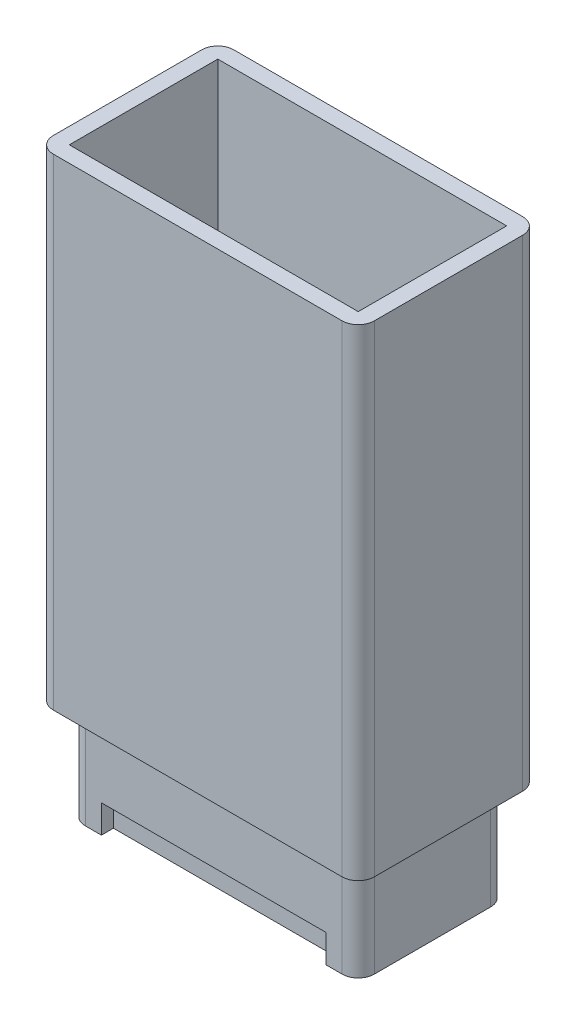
ISO-10303-21;
HEADER;
FILE_DESCRIPTION(('STEP AP214'),'2;1');
FILE_NAME('part.step','',(''),(''),'','','');
FILE_SCHEMA(('AUTOMOTIVE_DESIGN { 1 0 10303 214 1 1 1 1 }'));
ENDSEC;
DATA;
#1=APPLICATION_CONTEXT('core data for automotive mechanical design processes');
#2=APPLICATION_PROTOCOL_DEFINITION('international standard','automotive_design',2000,#1);
#3=PRODUCT_CONTEXT('',#1,'mechanical');
#4=PRODUCT('Part','Part','',(#3));
#5=PRODUCT_RELATED_PRODUCT_CATEGORY('part','',(#4));
#6=PRODUCT_DEFINITION_FORMATION('','',#4);
#7=PRODUCT_DEFINITION_CONTEXT('part definition',#1,'design');
#8=PRODUCT_DEFINITION('design','',#6,#7);
#9=PRODUCT_DEFINITION_SHAPE('','',#8);
#10=(LENGTH_UNIT() NAMED_UNIT(*) SI_UNIT(.MILLI.,.METRE.));
#11=(NAMED_UNIT(*) PLANE_ANGLE_UNIT() SI_UNIT($,.RADIAN.));
#12=(NAMED_UNIT(*) SI_UNIT($,.STERADIAN.) SOLID_ANGLE_UNIT());
#13=UNCERTAINTY_MEASURE_WITH_UNIT(LENGTH_MEASURE(1.E-05),#10,'distance_accuracy_value','');
#14=(GEOMETRIC_REPRESENTATION_CONTEXT(3) GLOBAL_UNCERTAINTY_ASSIGNED_CONTEXT((#13)) GLOBAL_UNIT_ASSIGNED_CONTEXT((#10,
#11,#12)) REPRESENTATION_CONTEXT('',''));
#15=CARTESIAN_POINT('',(0.,0.,0.));
#16=DIRECTION('',(0.,0.,1.));
#17=DIRECTION('',(1.,0.,0.));
#18=AXIS2_PLACEMENT_3D('',#15,#16,#17);
#19=CARTESIAN_POINT('',(0.,0.,0.));
#20=DIRECTION('',(0.,1.,0.));
#21=DIRECTION('',(0.,0.,1.));
#22=AXIS2_PLACEMENT_3D('',#19,#20,#21);
#23=PLANE('',#22);
#24=DIRECTION('',(1.,0.,0.));
#25=VECTOR('',#24,1.);
#26=CARTESIAN_POINT('',(40.,0.,22.5));
#27=LINE('',#26,#25);
#28=CARTESIAN_POINT('',(-36.,0.,22.5));
#29=VERTEX_POINT('',#28);
#30=CARTESIAN_POINT('',(36.,0.,22.5));
#31=VERTEX_POINT('',#30);
#32=EDGE_CURVE('E368',#29,#31,#27,.T.);
#33=ORIENTED_EDGE('',*,*,#32,.F.);
#34=CARTESIAN_POINT('',(-36.,0.,18.5));
#35=DIRECTION('',(0.,1.,0.));
#36=DIRECTION('',(0.,0.,1.));
#37=AXIS2_PLACEMENT_3D('',#34,#35,#36);
#38=CIRCLE('',#37,4.);
#39=CARTESIAN_POINT('',(-40.,0.,18.5));
#40=VERTEX_POINT('',#39);
#41=EDGE_CURVE('E423',#29,#40,#38,.F.);
#42=ORIENTED_EDGE('',*,*,#41,.T.);
#43=DIRECTION('',(0.,0.,1.));
#44=VECTOR('',#43,1.);
#45=CARTESIAN_POINT('',(-40.,0.,22.5));
#46=LINE('',#45,#44);
#47=CARTESIAN_POINT('',(-40.,0.,-18.5));
#48=VERTEX_POINT('',#47);
#49=EDGE_CURVE('E341',#48,#40,#46,.T.);
#50=ORIENTED_EDGE('',*,*,#49,.F.);
#51=CARTESIAN_POINT('',(-36.,0.,-18.5));
#52=DIRECTION('',(0.,1.,0.));
#53=DIRECTION('',(0.,0.,1.));
#54=AXIS2_PLACEMENT_3D('',#51,#52,#53);
#55=CIRCLE('',#54,4.);
#56=CARTESIAN_POINT('',(-36.,0.,-22.5));
#57=VERTEX_POINT('',#56);
#58=EDGE_CURVE('E421',#48,#57,#55,.F.);
#59=ORIENTED_EDGE('',*,*,#58,.T.);
#60=DIRECTION('',(-1.,0.,0.));
#61=VECTOR('',#60,1.);
#62=CARTESIAN_POINT('',(40.,0.,-22.5));
#63=LINE('',#62,#61);
#64=CARTESIAN_POINT('',(36.,0.,-22.5));
#65=VERTEX_POINT('',#64);
#66=EDGE_CURVE('E356',#65,#57,#63,.T.);
#67=ORIENTED_EDGE('',*,*,#66,.F.);
#68=CARTESIAN_POINT('',(36.,0.,-18.5));
#69=DIRECTION('',(0.,1.,0.));
#70=DIRECTION('',(0.,0.,1.));
#71=AXIS2_PLACEMENT_3D('',#68,#69,#70);
#72=CIRCLE('',#71,4.);
#73=CARTESIAN_POINT('',(40.,0.,-18.5));
#74=VERTEX_POINT('',#73);
#75=EDGE_CURVE('E419',#65,#74,#72,.F.);
#76=ORIENTED_EDGE('',*,*,#75,.T.);
#77=DIRECTION('',(0.,0.,-1.));
#78=VECTOR('',#77,1.);
#79=CARTESIAN_POINT('',(40.,0.,22.5));
#80=LINE('',#79,#78);
#81=CARTESIAN_POINT('',(40.,0.,18.5));
#82=VERTEX_POINT('',#81);
#83=EDGE_CURVE('E371',#82,#74,#80,.T.);
#84=ORIENTED_EDGE('',*,*,#83,.F.);
#85=CARTESIAN_POINT('',(36.,0.,18.5));
#86=DIRECTION('',(0.,1.,0.));
#87=DIRECTION('',(0.,0.,1.));
#88=AXIS2_PLACEMENT_3D('',#85,#86,#87);
#89=CIRCLE('',#88,4.);
#90=EDGE_CURVE('E417',#82,#31,#89,.F.);
#91=ORIENTED_EDGE('',*,*,#90,.T.);
#92=EDGE_LOOP('',(#33,#42,#50,#59,#67,#76,#84,#91));
#93=FACE_BOUND('',#92,.T.);
#94=DIRECTION('',(0.,0.,-1.));
#95=VECTOR('',#94,1.);
#96=CARTESIAN_POINT('',(-36.,0.,-18.5));
#97=LINE('',#96,#95);
#98=CARTESIAN_POINT('',(-36.,0.,14.5));
#99=VERTEX_POINT('',#98);
#100=CARTESIAN_POINT('',(-36.,0.,-14.5));
#101=VERTEX_POINT('',#100);
#102=EDGE_CURVE('E308',#99,#101,#97,.T.);
#103=ORIENTED_EDGE('',*,*,#102,.F.);
#104=CARTESIAN_POINT('',(-32.,0.,14.5));
#105=DIRECTION('',(0.,1.,0.));
#106=DIRECTION('',(0.,0.,1.));
#107=AXIS2_PLACEMENT_3D('',#104,#105,#106);
#108=CIRCLE('',#107,4.);
#109=CARTESIAN_POINT('',(-32.,0.,18.5));
#110=VERTEX_POINT('',#109);
#111=EDGE_CURVE('E410',#99,#110,#108,.T.);
#112=ORIENTED_EDGE('',*,*,#111,.T.);
#113=DIRECTION('',(-1.,0.,0.));
#114=VECTOR('',#113,1.);
#115=CARTESIAN_POINT('',(36.,0.,18.5));
#116=LINE('',#115,#114);
#117=CARTESIAN_POINT('',(32.,0.,18.5));
#118=VERTEX_POINT('',#117);
#119=EDGE_CURVE('E331',#118,#110,#116,.T.);
#120=ORIENTED_EDGE('',*,*,#119,.F.);
#121=CARTESIAN_POINT('',(32.,0.,14.5));
#122=DIRECTION('',(0.,1.,0.));
#123=DIRECTION('',(0.,0.,1.));
#124=AXIS2_PLACEMENT_3D('',#121,#122,#123);
#125=CIRCLE('',#124,4.);
#126=CARTESIAN_POINT('',(36.,0.,14.5));
#127=VERTEX_POINT('',#126);
#128=EDGE_CURVE('E406',#118,#127,#125,.T.);
#129=ORIENTED_EDGE('',*,*,#128,.T.);
#130=DIRECTION('',(0.,0.,1.));
#131=VECTOR('',#130,1.);
#132=CARTESIAN_POINT('',(36.,0.,-18.5));
#133=LINE('',#132,#131);
#134=CARTESIAN_POINT('',(36.,0.,-14.5));
#135=VERTEX_POINT('',#134);
#136=EDGE_CURVE('E347',#135,#127,#133,.T.);
#137=ORIENTED_EDGE('',*,*,#136,.F.);
#138=CARTESIAN_POINT('',(32.,0.,-14.5));
#139=DIRECTION('',(0.,1.,0.));
#140=DIRECTION('',(0.,0.,1.));
#141=AXIS2_PLACEMENT_3D('',#138,#139,#140);
#142=CIRCLE('',#141,4.);
#143=CARTESIAN_POINT('',(32.,0.,-18.5));
#144=VERTEX_POINT('',#143);
#145=EDGE_CURVE('E404',#135,#144,#142,.T.);
#146=ORIENTED_EDGE('',*,*,#145,.T.);
#147=DIRECTION('',(1.,0.,0.));
#148=VECTOR('',#147,1.);
#149=CARTESIAN_POINT('',(36.,0.,-18.5));
#150=LINE('',#149,#148);
#151=CARTESIAN_POINT('',(-32.,0.,-18.5));
#152=VERTEX_POINT('',#151);
#153=EDGE_CURVE('E344',#152,#144,#150,.T.);
#154=ORIENTED_EDGE('',*,*,#153,.F.);
#155=CARTESIAN_POINT('',(-32.,0.,-14.5));
#156=DIRECTION('',(0.,1.,0.));
#157=DIRECTION('',(0.,0.,1.));
#158=AXIS2_PLACEMENT_3D('',#155,#156,#157);
#159=CIRCLE('',#158,4.);
#160=EDGE_CURVE('E408',#152,#101,#159,.T.);
#161=ORIENTED_EDGE('',*,*,#160,.T.);
#162=EDGE_LOOP('',(#103,#112,#120,#129,#137,#146,#154,#161));
#163=FACE_BOUND('',#162,.T.);
#164=ADVANCED_FACE('F35',(#93,#163),#23,.F.);
#165=CARTESIAN_POINT('',(-40.,120.,22.5));
#166=DIRECTION('',(1.,0.,0.));
#167=DIRECTION('',(0.,0.,-1.));
#168=AXIS2_PLACEMENT_3D('',#165,#166,#167);
#169=PLANE('',#168);
#170=ORIENTED_EDGE('',*,*,#49,.T.);
#171=DIRECTION('',(0.,-1.,0.));
#172=VECTOR('',#171,1.);
#173=CARTESIAN_POINT('',(-40.,120.,18.5));
#174=LINE('',#173,#172);
#175=CARTESIAN_POINT('',(-40.,120.,18.5));
#176=VERTEX_POINT('',#175);
#177=EDGE_CURVE('E428',#40,#176,#174,.F.);
#178=ORIENTED_EDGE('',*,*,#177,.T.);
#179=DIRECTION('',(0.,0.,1.));
#180=VECTOR('',#179,1.);
#181=CARTESIAN_POINT('',(-40.,120.,22.5));
#182=LINE('',#181,#180);
#183=CARTESIAN_POINT('',(-40.,120.,-18.5));
#184=VERTEX_POINT('',#183);
#185=EDGE_CURVE('E352',#184,#176,#182,.T.);
#186=ORIENTED_EDGE('',*,*,#185,.F.);
#187=DIRECTION('',(0.,-1.,0.));
#188=VECTOR('',#187,1.);
#189=CARTESIAN_POINT('',(-40.,120.,-18.5));
#190=LINE('',#189,#188);
#191=EDGE_CURVE('E425',#184,#48,#190,.T.);
#192=ORIENTED_EDGE('',*,*,#191,.T.);
#193=EDGE_LOOP('',(#170,#178,#186,#192));
#194=FACE_BOUND('',#193,.T.);
#195=ADVANCED_FACE('F472',(#194),#169,.F.);
#196=CARTESIAN_POINT('',(40.,120.,22.5));
#197=DIRECTION('',(0.,0.,-1.));
#198=DIRECTION('',(-1.,0.,0.));
#199=AXIS2_PLACEMENT_3D('',#196,#197,#198);
#200=PLANE('',#199);
#201=DIRECTION('',(1.,0.,0.));
#202=VECTOR('',#201,1.);
#203=CARTESIAN_POINT('',(40.,120.,22.5));
#204=LINE('',#203,#202);
#205=CARTESIAN_POINT('',(-36.,120.,22.5));
#206=VERTEX_POINT('',#205);
#207=CARTESIAN_POINT('',(36.,120.,22.5));
#208=VERTEX_POINT('',#207);
#209=EDGE_CURVE('E355',#206,#208,#204,.T.);
#210=ORIENTED_EDGE('',*,*,#209,.F.);
#211=DIRECTION('',(0.,-1.,0.));
#212=VECTOR('',#211,1.);
#213=CARTESIAN_POINT('',(-36.,120.,22.5));
#214=LINE('',#213,#212);
#215=EDGE_CURVE('E414',#206,#29,#214,.T.);
#216=ORIENTED_EDGE('',*,*,#215,.T.);
#217=ORIENTED_EDGE('',*,*,#32,.T.);
#218=DIRECTION('',(0.,-1.,0.));
#219=VECTOR('',#218,1.);
#220=CARTESIAN_POINT('',(36.,120.,22.5));
#221=LINE('',#220,#219);
#222=EDGE_CURVE('E412',#31,#208,#221,.F.);
#223=ORIENTED_EDGE('',*,*,#222,.T.);
#224=EDGE_LOOP('',(#210,#216,#217,#223));
#225=FACE_BOUND('',#224,.T.);
#226=ADVANCED_FACE('F480',(#225),#200,.F.);
#227=CARTESIAN_POINT('',(40.,120.,22.5));
#228=DIRECTION('',(-1.,0.,0.));
#229=DIRECTION('',(0.,0.,1.));
#230=AXIS2_PLACEMENT_3D('',#227,#228,#229);
#231=PLANE('',#230);
#232=ORIENTED_EDGE('',*,*,#83,.T.);
#233=DIRECTION('',(0.,-1.,0.));
#234=VECTOR('',#233,1.);
#235=CARTESIAN_POINT('',(40.,120.,-18.5));
#236=LINE('',#235,#234);
#237=CARTESIAN_POINT('',(40.,120.,-18.5));
#238=VERTEX_POINT('',#237);
#239=EDGE_CURVE('E11',#74,#238,#236,.F.);
#240=ORIENTED_EDGE('',*,*,#239,.T.);
#241=DIRECTION('',(0.,0.,-1.));
#242=VECTOR('',#241,1.);
#243=CARTESIAN_POINT('',(40.,120.,22.5));
#244=LINE('',#243,#242);
#245=CARTESIAN_POINT('',(40.,120.,18.5));
#246=VERTEX_POINT('',#245);
#247=EDGE_CURVE('E359',#246,#238,#244,.T.);
#248=ORIENTED_EDGE('',*,*,#247,.F.);
#249=DIRECTION('',(0.,-1.,0.));
#250=VECTOR('',#249,1.);
#251=CARTESIAN_POINT('',(40.,120.,18.5));
#252=LINE('',#251,#250);
#253=EDGE_CURVE('E43',#246,#82,#252,.T.);
#254=ORIENTED_EDGE('',*,*,#253,.T.);
#255=EDGE_LOOP('',(#232,#240,#248,#254));
#256=FACE_BOUND('',#255,.T.);
#257=ADVANCED_FACE('F447',(#256),#231,.F.);
#258=CARTESIAN_POINT('',(40.,120.,-22.5));
#259=DIRECTION('',(0.,0.,1.));
#260=DIRECTION('',(1.,0.,0.));
#261=AXIS2_PLACEMENT_3D('',#258,#259,#260);
#262=PLANE('',#261);
#263=ORIENTED_EDGE('',*,*,#66,.T.);
#264=DIRECTION('',(0.,-1.,0.));
#265=VECTOR('',#264,1.);
#266=CARTESIAN_POINT('',(-36.,120.,-22.5));
#267=LINE('',#266,#265);
#268=CARTESIAN_POINT('',(-36.,120.,-22.5));
#269=VERTEX_POINT('',#268);
#270=EDGE_CURVE('E441',#57,#269,#267,.F.);
#271=ORIENTED_EDGE('',*,*,#270,.T.);
#272=DIRECTION('',(-1.,0.,0.));
#273=VECTOR('',#272,1.);
#274=CARTESIAN_POINT('',(40.,120.,-22.5));
#275=LINE('',#274,#273);
#276=CARTESIAN_POINT('',(36.,120.,-22.5));
#277=VERTEX_POINT('',#276);
#278=EDGE_CURVE('E362',#277,#269,#275,.T.);
#279=ORIENTED_EDGE('',*,*,#278,.F.);
#280=DIRECTION('',(0.,-1.,0.));
#281=VECTOR('',#280,1.);
#282=CARTESIAN_POINT('',(36.,120.,-22.5));
#283=LINE('',#282,#281);
#284=EDGE_CURVE('E438',#277,#65,#283,.T.);
#285=ORIENTED_EDGE('',*,*,#284,.T.);
#286=EDGE_LOOP('',(#263,#271,#279,#285));
#287=FACE_BOUND('',#286,.T.);
#288=ADVANCED_FACE('F461',(#287),#262,.F.);
#289=CARTESIAN_POINT('',(0.,120.,0.));
#290=DIRECTION('',(0.,1.,0.));
#291=DIRECTION('',(0.,0.,1.));
#292=AXIS2_PLACEMENT_3D('',#289,#290,#291);
#293=PLANE('',#292);
#294=DIRECTION('',(0.,0.,1.));
#295=VECTOR('',#294,1.);
#296=CARTESIAN_POINT('',(-36.,120.,22.5));
#297=LINE('',#296,#295);
#298=CARTESIAN_POINT('',(-36.,120.,-18.5));
#299=VERTEX_POINT('',#298);
#300=CARTESIAN_POINT('',(-36.,120.,18.5));
#301=VERTEX_POINT('',#300);
#302=EDGE_CURVE('E279',#299,#301,#297,.T.);
#303=ORIENTED_EDGE('',*,*,#302,.F.);
#304=DIRECTION('',(-1.,0.,0.));
#305=VECTOR('',#304,1.);
#306=CARTESIAN_POINT('',(40.,120.,-18.5));
#307=LINE('',#306,#305);
#308=CARTESIAN_POINT('',(36.,120.,-18.5));
#309=VERTEX_POINT('',#308);
#310=EDGE_CURVE('E300',#309,#299,#307,.T.);
#311=ORIENTED_EDGE('',*,*,#310,.F.);
#312=DIRECTION('',(0.,0.,-1.));
#313=VECTOR('',#312,1.);
#314=CARTESIAN_POINT('',(36.,120.,22.5));
#315=LINE('',#314,#313);
#316=CARTESIAN_POINT('',(36.,120.,18.5));
#317=VERTEX_POINT('',#316);
#318=EDGE_CURVE('E318',#317,#309,#315,.T.);
#319=ORIENTED_EDGE('',*,*,#318,.F.);
#320=DIRECTION('',(1.,0.,0.));
#321=VECTOR('',#320,1.);
#322=CARTESIAN_POINT('',(40.,120.,18.5));
#323=LINE('',#322,#321);
#324=EDGE_CURVE('E316',#301,#317,#323,.T.);
#325=ORIENTED_EDGE('',*,*,#324,.F.);
#326=EDGE_LOOP('',(#303,#311,#319,#325));
#327=FACE_BOUND('',#326,.T.);
#328=ORIENTED_EDGE('',*,*,#185,.T.);
#329=CARTESIAN_POINT('',(-36.,120.,18.5));
#330=DIRECTION('',(0.,1.,0.));
#331=DIRECTION('',(0.,0.,1.));
#332=AXIS2_PLACEMENT_3D('',#329,#330,#331);
#333=CIRCLE('',#332,4.);
#334=EDGE_CURVE('E436',#176,#206,#333,.T.);
#335=ORIENTED_EDGE('',*,*,#334,.T.);
#336=ORIENTED_EDGE('',*,*,#209,.T.);
#337=CARTESIAN_POINT('',(36.,120.,18.5));
#338=DIRECTION('',(0.,1.,0.));
#339=DIRECTION('',(0.,0.,1.));
#340=AXIS2_PLACEMENT_3D('',#337,#338,#339);
#341=CIRCLE('',#340,4.);
#342=EDGE_CURVE('E430',#208,#246,#341,.T.);
#343=ORIENTED_EDGE('',*,*,#342,.T.);
#344=ORIENTED_EDGE('',*,*,#247,.T.);
#345=CARTESIAN_POINT('',(36.,120.,-18.5));
#346=DIRECTION('',(0.,1.,0.));
#347=DIRECTION('',(0.,0.,1.));
#348=AXIS2_PLACEMENT_3D('',#345,#346,#347);
#349=CIRCLE('',#348,4.);
#350=EDGE_CURVE('E432',#238,#277,#349,.T.);
#351=ORIENTED_EDGE('',*,*,#350,.T.);
#352=ORIENTED_EDGE('',*,*,#278,.T.);
#353=CARTESIAN_POINT('',(-36.,120.,-18.5));
#354=DIRECTION('',(0.,1.,0.));
#355=DIRECTION('',(0.,0.,1.));
#356=AXIS2_PLACEMENT_3D('',#353,#354,#355);
#357=CIRCLE('',#356,4.);
#358=EDGE_CURVE('E434',#269,#184,#357,.T.);
#359=ORIENTED_EDGE('',*,*,#358,.T.);
#360=EDGE_LOOP('',(#328,#335,#336,#343,#344,#351,#352,#359));
#361=FACE_BOUND('',#360,.T.);
#362=ADVANCED_FACE('F465',(#327,#361),#293,.T.);
#363=CARTESIAN_POINT('',(-36.,-25.,-18.5));
#364=DIRECTION('',(1.,0.,0.));
#365=DIRECTION('',(0.,0.,-1.));
#366=AXIS2_PLACEMENT_3D('',#363,#364,#365);
#367=PLANE('',#366);
#368=ORIENTED_EDGE('',*,*,#102,.T.);
#369=DIRECTION('',(0.,1.,0.));
#370=VECTOR('',#369,1.);
#371=CARTESIAN_POINT('',(-36.,-25.,-14.5));
#372=LINE('',#371,#370);
#373=CARTESIAN_POINT('',(-36.,-25.,-14.5));
#374=VERTEX_POINT('',#373);
#375=EDGE_CURVE('E402',#101,#374,#372,.F.);
#376=ORIENTED_EDGE('',*,*,#375,.T.);
#377=DIRECTION('',(0.,0.,-1.));
#378=VECTOR('',#377,1.);
#379=CARTESIAN_POINT('',(-36.,-25.,-18.5));
#380=LINE('',#379,#378);
#381=CARTESIAN_POINT('',(-36.,-25.,14.5));
#382=VERTEX_POINT('',#381);
#383=EDGE_CURVE('E327',#382,#374,#380,.T.);
#384=ORIENTED_EDGE('',*,*,#383,.F.);
#385=DIRECTION('',(0.,1.,0.));
#386=VECTOR('',#385,1.);
#387=CARTESIAN_POINT('',(-36.,-25.,14.5));
#388=LINE('',#387,#386);
#389=EDGE_CURVE('E399',#382,#99,#388,.T.);
#390=ORIENTED_EDGE('',*,*,#389,.T.);
#391=EDGE_LOOP('',(#368,#376,#384,#390));
#392=FACE_BOUND('',#391,.T.);
#393=ADVANCED_FACE('F676',(#392),#367,.F.);
#394=CARTESIAN_POINT('',(36.,-25.,-18.5));
#395=DIRECTION('',(0.,0.,1.));
#396=DIRECTION('',(1.,0.,0.));
#397=AXIS2_PLACEMENT_3D('',#394,#395,#396);
#398=PLANE('',#397);
#399=ORIENTED_EDGE('',*,*,#153,.T.);
#400=DIRECTION('',(0.,1.,0.));
#401=VECTOR('',#400,1.);
#402=CARTESIAN_POINT('',(32.,-25.,-18.5));
#403=LINE('',#402,#401);
#404=CARTESIAN_POINT('',(32.,-25.,-18.5));
#405=VERTEX_POINT('',#404);
#406=EDGE_CURVE('E383',#144,#405,#403,.F.);
#407=ORIENTED_EDGE('',*,*,#406,.T.);
#408=DIRECTION('',(1.,0.,0.));
#409=VECTOR('',#408,1.);
#410=CARTESIAN_POINT('',(36.,-25.,-18.5));
#411=LINE('',#410,#409);
#412=CARTESIAN_POINT('',(-32.,-25.,-18.5));
#413=VERTEX_POINT('',#412);
#414=EDGE_CURVE('E330',#413,#405,#411,.T.);
#415=ORIENTED_EDGE('',*,*,#414,.F.);
#416=DIRECTION('',(0.,1.,0.));
#417=VECTOR('',#416,1.);
#418=CARTESIAN_POINT('',(-32.,-25.,-18.5));
#419=LINE('',#418,#417);
#420=EDGE_CURVE('E380',#413,#152,#419,.T.);
#421=ORIENTED_EDGE('',*,*,#420,.T.);
#422=EDGE_LOOP('',(#399,#407,#415,#421));
#423=FACE_BOUND('',#422,.T.);
#424=ADVANCED_FACE('F673',(#423),#398,.F.);
#425=CARTESIAN_POINT('',(36.,-25.,-18.5));
#426=DIRECTION('',(-1.,0.,0.));
#427=DIRECTION('',(0.,0.,1.));
#428=AXIS2_PLACEMENT_3D('',#425,#426,#427);
#429=PLANE('',#428);
#430=DIRECTION('',(0.,0.,1.));
#431=VECTOR('',#430,1.);
#432=CARTESIAN_POINT('',(36.,-25.,-18.5));
#433=LINE('',#432,#431);
#434=CARTESIAN_POINT('',(36.,-25.,-14.5));
#435=VERTEX_POINT('',#434);
#436=CARTESIAN_POINT('',(36.,-25.,14.5));
#437=VERTEX_POINT('',#436);
#438=EDGE_CURVE('E334',#435,#437,#433,.T.);
#439=ORIENTED_EDGE('',*,*,#438,.F.);
#440=DIRECTION('',(0.,1.,0.));
#441=VECTOR('',#440,1.);
#442=CARTESIAN_POINT('',(36.,-25.,-14.5));
#443=LINE('',#442,#441);
#444=EDGE_CURVE('E377',#435,#135,#443,.T.);
#445=ORIENTED_EDGE('',*,*,#444,.T.);
#446=ORIENTED_EDGE('',*,*,#136,.T.);
#447=DIRECTION('',(0.,1.,0.));
#448=VECTOR('',#447,1.);
#449=CARTESIAN_POINT('',(36.,-25.,14.5));
#450=LINE('',#449,#448);
#451=EDGE_CURVE('E365',#127,#437,#450,.F.);
#452=ORIENTED_EDGE('',*,*,#451,.T.);
#453=EDGE_LOOP('',(#439,#445,#446,#452));
#454=FACE_BOUND('',#453,.T.);
#455=ADVANCED_FACE('F550',(#454),#429,.F.);
#456=CARTESIAN_POINT('',(36.,-25.,18.5));
#457=DIRECTION('',(0.,0.,-1.));
#458=DIRECTION('',(-1.,0.,0.));
#459=AXIS2_PLACEMENT_3D('',#456,#457,#458);
#460=PLANE('',#459);
#461=DIRECTION('',(-1.,0.,0.));
#462=VECTOR('',#461,1.);
#463=CARTESIAN_POINT('',(-28.,-18.,18.5));
#464=LINE('',#463,#462);
#465=CARTESIAN_POINT('',(28.,-18.,18.5));
#466=VERTEX_POINT('',#465);
#467=CARTESIAN_POINT('',(-28.,-18.,18.5));
#468=VERTEX_POINT('',#467);
#469=EDGE_CURVE('E255',#466,#468,#464,.T.);
#470=ORIENTED_EDGE('',*,*,#469,.F.);
#471=DIRECTION('',(0.,1.,0.));
#472=VECTOR('',#471,1.);
#473=CARTESIAN_POINT('',(28.,-25.,18.5));
#474=LINE('',#473,#472);
#475=CARTESIAN_POINT('',(28.,-25.,18.5));
#476=VERTEX_POINT('',#475);
#477=EDGE_CURVE('E236',#476,#466,#474,.T.);
#478=ORIENTED_EDGE('',*,*,#477,.F.);
#479=DIRECTION('',(-1.,0.,0.));
#480=VECTOR('',#479,1.);
#481=CARTESIAN_POINT('',(36.,-25.,18.5));
#482=LINE('',#481,#480);
#483=CARTESIAN_POINT('',(32.,-25.,18.5));
#484=VERTEX_POINT('',#483);
#485=EDGE_CURVE('E338',#484,#476,#482,.T.);
#486=ORIENTED_EDGE('',*,*,#485,.F.);
#487=DIRECTION('',(0.,1.,0.));
#488=VECTOR('',#487,1.);
#489=CARTESIAN_POINT('',(32.,-25.,18.5));
#490=LINE('',#489,#488);
#491=EDGE_CURVE('E396',#484,#118,#490,.T.);
#492=ORIENTED_EDGE('',*,*,#491,.T.);
#493=ORIENTED_EDGE('',*,*,#119,.T.);
#494=DIRECTION('',(0.,1.,0.));
#495=VECTOR('',#494,1.);
#496=CARTESIAN_POINT('',(-32.,-25.,18.5));
#497=LINE('',#496,#495);
#498=CARTESIAN_POINT('',(-32.,-25.,18.5));
#499=VERTEX_POINT('',#498);
#500=EDGE_CURVE('E393',#110,#499,#497,.F.);
#501=ORIENTED_EDGE('',*,*,#500,.T.);
#502=CARTESIAN_POINT('',(-28.,-25.,18.5));
#503=VERTEX_POINT('',#502);
#504=EDGE_CURVE('E337',#503,#499,#482,.T.);
#505=ORIENTED_EDGE('',*,*,#504,.F.);
#506=DIRECTION('',(0.,-1.,0.));
#507=VECTOR('',#506,1.);
#508=CARTESIAN_POINT('',(-28.,-25.,18.5));
#509=LINE('',#508,#507);
#510=EDGE_CURVE('E253',#468,#503,#509,.T.);
#511=ORIENTED_EDGE('',*,*,#510,.F.);
#512=EDGE_LOOP('',(#470,#478,#486,#492,#493,#501,#505,#511));
#513=FACE_BOUND('',#512,.T.);
#514=ADVANCED_FACE('F545',(#513),#460,.F.);
#515=CARTESIAN_POINT('',(0.,-25.,0.));
#516=DIRECTION('',(0.,-1.,0.));
#517=DIRECTION('',(0.,0.,-1.));
#518=AXIS2_PLACEMENT_3D('',#515,#516,#517);
#519=PLANE('',#518);
#520=DIRECTION('',(0.,0.,-1.));
#521=VECTOR('',#520,1.);
#522=CARTESIAN_POINT('',(-32.,-25.,-18.5));
#523=LINE('',#522,#521);
#524=CARTESIAN_POINT('',(-32.,-25.,11.5));
#525=VERTEX_POINT('',#524);
#526=CARTESIAN_POINT('',(-32.,-25.,-14.5));
#527=VERTEX_POINT('',#526);
#528=EDGE_CURVE('E287',#525,#527,#523,.T.);
#529=ORIENTED_EDGE('',*,*,#528,.F.);
#530=DIRECTION('',(1.,0.,0.));
#531=VECTOR('',#530,1.);
#532=CARTESIAN_POINT('',(-32.,-25.,11.5));
#533=LINE('',#532,#531);
#534=CARTESIAN_POINT('',(32.,-25.,11.5));
#535=VERTEX_POINT('',#534);
#536=EDGE_CURVE('E742',#525,#535,#533,.T.);
#537=ORIENTED_EDGE('',*,*,#536,.T.);
#538=DIRECTION('',(0.,0.,1.));
#539=VECTOR('',#538,1.);
#540=CARTESIAN_POINT('',(32.,-25.,-18.5));
#541=LINE('',#540,#539);
#542=CARTESIAN_POINT('',(32.,-25.,-14.5));
#543=VERTEX_POINT('',#542);
#544=EDGE_CURVE('E276',#543,#535,#541,.T.);
#545=ORIENTED_EDGE('',*,*,#544,.F.);
#546=DIRECTION('',(1.,0.,0.));
#547=VECTOR('',#546,1.);
#548=CARTESIAN_POINT('',(36.,-25.,-14.5));
#549=LINE('',#548,#547);
#550=EDGE_CURVE('E323',#527,#543,#549,.T.);
#551=ORIENTED_EDGE('',*,*,#550,.F.);
#552=EDGE_LOOP('',(#529,#537,#545,#551));
#553=FACE_BOUND('',#552,.T.);
#554=DIRECTION('',(0.,0.,1.));
#555=VECTOR('',#554,1.);
#556=CARTESIAN_POINT('',(28.,-25.,15.5));
#557=LINE('',#556,#555);
#558=CARTESIAN_POINT('',(28.,-25.,15.5));
#559=VERTEX_POINT('',#558);
#560=EDGE_CURVE('E265',#559,#476,#557,.T.);
#561=ORIENTED_EDGE('',*,*,#560,.F.);
#562=DIRECTION('',(1.,0.,0.));
#563=VECTOR('',#562,1.);
#564=CARTESIAN_POINT('',(-28.,-25.,15.5));
#565=LINE('',#564,#563);
#566=CARTESIAN_POINT('',(-28.,-25.,15.5));
#567=VERTEX_POINT('',#566);
#568=EDGE_CURVE('E241',#567,#559,#565,.T.);
#569=ORIENTED_EDGE('',*,*,#568,.F.);
#570=DIRECTION('',(0.,0.,1.));
#571=VECTOR('',#570,1.);
#572=CARTESIAN_POINT('',(-28.,-25.,15.5));
#573=LINE('',#572,#571);
#574=EDGE_CURVE('E268',#567,#503,#573,.T.);
#575=ORIENTED_EDGE('',*,*,#574,.T.);
#576=ORIENTED_EDGE('',*,*,#504,.T.);
#577=CARTESIAN_POINT('',(-32.,-25.,14.5));
#578=DIRECTION('',(0.,-1.,0.));
#579=DIRECTION('',(0.,0.,-1.));
#580=AXIS2_PLACEMENT_3D('',#577,#578,#579);
#581=CIRCLE('',#580,4.);
#582=EDGE_CURVE('E385',#499,#382,#581,.T.);
#583=ORIENTED_EDGE('',*,*,#582,.T.);
#584=ORIENTED_EDGE('',*,*,#383,.T.);
#585=CARTESIAN_POINT('',(-32.,-25.,-14.5));
#586=DIRECTION('',(0.,-1.,0.));
#587=DIRECTION('',(0.,0.,-1.));
#588=AXIS2_PLACEMENT_3D('',#585,#586,#587);
#589=CIRCLE('',#588,4.);
#590=EDGE_CURVE('E387',#374,#413,#589,.T.);
#591=ORIENTED_EDGE('',*,*,#590,.T.);
#592=ORIENTED_EDGE('',*,*,#414,.T.);
#593=CARTESIAN_POINT('',(32.,-25.,-14.5));
#594=DIRECTION('',(0.,-1.,0.));
#595=DIRECTION('',(0.,0.,-1.));
#596=AXIS2_PLACEMENT_3D('',#593,#594,#595);
#597=CIRCLE('',#596,4.);
#598=EDGE_CURVE('E391',#405,#435,#597,.T.);
#599=ORIENTED_EDGE('',*,*,#598,.T.);
#600=ORIENTED_EDGE('',*,*,#438,.T.);
#601=CARTESIAN_POINT('',(32.,-25.,14.5));
#602=DIRECTION('',(0.,-1.,0.));
#603=DIRECTION('',(0.,0.,-1.));
#604=AXIS2_PLACEMENT_3D('',#601,#602,#603);
#605=CIRCLE('',#604,4.);
#606=EDGE_CURVE('E389',#437,#484,#605,.T.);
#607=ORIENTED_EDGE('',*,*,#606,.T.);
#608=ORIENTED_EDGE('',*,*,#485,.T.);
#609=EDGE_LOOP('',(#561,#569,#575,#576,#583,#584,#591,#592,#599,#600,#607,#608));
#610=FACE_BOUND('',#609,.T.);
#611=ADVANCED_FACE('F508',(#553,#610),#519,.T.);
#612=CARTESIAN_POINT('',(32.,-25.,-14.5));
#613=DIRECTION('',(0.,1.,0.));
#614=DIRECTION('',(0.,0.,1.));
#615=AXIS2_PLACEMENT_3D('',#612,#613,#614);
#616=CYLINDRICAL_SURFACE('',#615,4.);
#617=ORIENTED_EDGE('',*,*,#598,.F.);
#618=ORIENTED_EDGE('',*,*,#406,.F.);
#619=ORIENTED_EDGE('',*,*,#145,.F.);
#620=ORIENTED_EDGE('',*,*,#444,.F.);
#621=EDGE_LOOP('',(#617,#618,#619,#620));
#622=FACE_BOUND('',#621,.T.);
#623=ADVANCED_FACE('F504',(#622),#616,.T.);
#624=CARTESIAN_POINT('',(32.,-25.,14.5));
#625=DIRECTION('',(0.,1.,0.));
#626=DIRECTION('',(0.,0.,1.));
#627=AXIS2_PLACEMENT_3D('',#624,#625,#626);
#628=CYLINDRICAL_SURFACE('',#627,4.);
#629=ORIENTED_EDGE('',*,*,#606,.F.);
#630=ORIENTED_EDGE('',*,*,#451,.F.);
#631=ORIENTED_EDGE('',*,*,#128,.F.);
#632=ORIENTED_EDGE('',*,*,#491,.F.);
#633=EDGE_LOOP('',(#629,#630,#631,#632));
#634=FACE_BOUND('',#633,.T.);
#635=ADVANCED_FACE('F507',(#634),#628,.T.);
#636=CARTESIAN_POINT('',(-32.,-25.,-14.5));
#637=DIRECTION('',(0.,1.,0.));
#638=DIRECTION('',(0.,0.,1.));
#639=AXIS2_PLACEMENT_3D('',#636,#637,#638);
#640=CYLINDRICAL_SURFACE('',#639,4.);
#641=ORIENTED_EDGE('',*,*,#590,.F.);
#642=ORIENTED_EDGE('',*,*,#375,.F.);
#643=ORIENTED_EDGE('',*,*,#160,.F.);
#644=ORIENTED_EDGE('',*,*,#420,.F.);
#645=EDGE_LOOP('',(#641,#642,#643,#644));
#646=FACE_BOUND('',#645,.T.);
#647=ADVANCED_FACE('F512',(#646),#640,.T.);
#648=CARTESIAN_POINT('',(-32.,-25.,14.5));
#649=DIRECTION('',(0.,1.,0.));
#650=DIRECTION('',(0.,0.,1.));
#651=AXIS2_PLACEMENT_3D('',#648,#649,#650);
#652=CYLINDRICAL_SURFACE('',#651,4.);
#653=ORIENTED_EDGE('',*,*,#582,.F.);
#654=ORIENTED_EDGE('',*,*,#500,.F.);
#655=ORIENTED_EDGE('',*,*,#111,.F.);
#656=ORIENTED_EDGE('',*,*,#389,.F.);
#657=EDGE_LOOP('',(#653,#654,#655,#656));
#658=FACE_BOUND('',#657,.T.);
#659=ADVANCED_FACE('F516',(#658),#652,.T.);
#660=CARTESIAN_POINT('',(0.,4.,0.));
#661=DIRECTION('',(0.,1.,0.));
#662=DIRECTION('',(0.,0.,1.));
#663=AXIS2_PLACEMENT_3D('',#660,#661,#662);
#664=PLANE('',#663);
#665=DIRECTION('',(0.,0.,1.));
#666=VECTOR('',#665,1.);
#667=CARTESIAN_POINT('',(-36.,4.,22.5));
#668=LINE('',#667,#666);
#669=CARTESIAN_POINT('',(-36.,4.,-18.5));
#670=VERTEX_POINT('',#669);
#671=CARTESIAN_POINT('',(-36.,4.,18.5));
#672=VERTEX_POINT('',#671);
#673=EDGE_CURVE('E272',#670,#672,#668,.T.);
#674=ORIENTED_EDGE('',*,*,#673,.T.);
#675=DIRECTION('',(1.,0.,0.));
#676=VECTOR('',#675,1.);
#677=CARTESIAN_POINT('',(40.,4.,18.5));
#678=LINE('',#677,#676);
#679=CARTESIAN_POINT('',(36.,4.,18.5));
#680=VERTEX_POINT('',#679);
#681=EDGE_CURVE('E275',#672,#680,#678,.T.);
#682=ORIENTED_EDGE('',*,*,#681,.T.);
#683=DIRECTION('',(0.,0.,-1.));
#684=VECTOR('',#683,1.);
#685=CARTESIAN_POINT('',(36.,4.,22.5));
#686=LINE('',#685,#684);
#687=CARTESIAN_POINT('',(36.,4.,-18.5));
#688=VERTEX_POINT('',#687);
#689=EDGE_CURVE('E280',#680,#688,#686,.T.);
#690=ORIENTED_EDGE('',*,*,#689,.T.);
#691=DIRECTION('',(-1.,0.,0.));
#692=VECTOR('',#691,1.);
#693=CARTESIAN_POINT('',(40.,4.,-18.5));
#694=LINE('',#693,#692);
#695=EDGE_CURVE('E277',#688,#670,#694,.T.);
#696=ORIENTED_EDGE('',*,*,#695,.T.);
#697=EDGE_LOOP('',(#674,#682,#690,#696));
#698=FACE_BOUND('',#697,.T.);
#699=DIRECTION('',(0.,0.,-1.));
#700=VECTOR('',#699,1.);
#701=CARTESIAN_POINT('',(-32.,4.,0.));
#702=LINE('',#701,#700);
#703=CARTESIAN_POINT('',(-32.,4.,14.5));
#704=VERTEX_POINT('',#703);
#705=CARTESIAN_POINT('',(-32.,4.,-14.5));
#706=VERTEX_POINT('',#705);
#707=EDGE_CURVE('E267',#704,#706,#702,.T.);
#708=ORIENTED_EDGE('',*,*,#707,.T.);
#709=DIRECTION('',(1.,0.,0.));
#710=VECTOR('',#709,1.);
#711=CARTESIAN_POINT('',(0.,4.,-14.5));
#712=LINE('',#711,#710);
#713=CARTESIAN_POINT('',(32.,4.,-14.5));
#714=VERTEX_POINT('',#713);
#715=EDGE_CURVE('E284',#706,#714,#712,.T.);
#716=ORIENTED_EDGE('',*,*,#715,.T.);
#717=DIRECTION('',(0.,0.,1.));
#718=VECTOR('',#717,1.);
#719=CARTESIAN_POINT('',(32.,4.,0.));
#720=LINE('',#719,#718);
#721=CARTESIAN_POINT('',(32.,4.,14.5));
#722=VERTEX_POINT('',#721);
#723=EDGE_CURVE('E288',#714,#722,#720,.T.);
#724=ORIENTED_EDGE('',*,*,#723,.T.);
#725=DIRECTION('',(-1.,0.,0.));
#726=VECTOR('',#725,1.);
#727=CARTESIAN_POINT('',(0.,4.,14.5));
#728=LINE('',#727,#726);
#729=EDGE_CURVE('E285',#722,#704,#728,.T.);
#730=ORIENTED_EDGE('',*,*,#729,.T.);
#731=EDGE_LOOP('',(#708,#716,#724,#730));
#732=FACE_BOUND('',#731,.T.);
#733=ADVANCED_FACE('F520',(#698,#732),#664,.T.);
#734=CARTESIAN_POINT('',(-36.,120.,22.5));
#735=DIRECTION('',(1.,0.,0.));
#736=DIRECTION('',(0.,0.,-1.));
#737=AXIS2_PLACEMENT_3D('',#734,#735,#736);
#738=PLANE('',#737);
#739=ORIENTED_EDGE('',*,*,#673,.F.);
#740=DIRECTION('',(0.,-1.,0.));
#741=VECTOR('',#740,1.);
#742=CARTESIAN_POINT('',(-36.,120.,-18.5));
#743=LINE('',#742,#741);
#744=EDGE_CURVE('E296',#299,#670,#743,.T.);
#745=ORIENTED_EDGE('',*,*,#744,.F.);
#746=ORIENTED_EDGE('',*,*,#302,.T.);
#747=DIRECTION('',(0.,-1.,0.));
#748=VECTOR('',#747,1.);
#749=CARTESIAN_POINT('',(-36.,120.,18.5));
#750=LINE('',#749,#748);
#751=EDGE_CURVE('E291',#301,#672,#750,.T.);
#752=ORIENTED_EDGE('',*,*,#751,.T.);
#753=EDGE_LOOP('',(#739,#745,#746,#752));
#754=FACE_BOUND('',#753,.T.);
#755=ADVANCED_FACE('F655',(#754),#738,.T.);
#756=CARTESIAN_POINT('',(40.,120.,18.5));
#757=DIRECTION('',(0.,0.,-1.));
#758=DIRECTION('',(-1.,0.,0.));
#759=AXIS2_PLACEMENT_3D('',#756,#757,#758);
#760=PLANE('',#759);
#761=ORIENTED_EDGE('',*,*,#681,.F.);
#762=ORIENTED_EDGE('',*,*,#751,.F.);
#763=ORIENTED_EDGE('',*,*,#324,.T.);
#764=DIRECTION('',(0.,-1.,0.));
#765=VECTOR('',#764,1.);
#766=CARTESIAN_POINT('',(36.,120.,18.5));
#767=LINE('',#766,#765);
#768=EDGE_CURVE('E295',#317,#680,#767,.T.);
#769=ORIENTED_EDGE('',*,*,#768,.T.);
#770=EDGE_LOOP('',(#761,#762,#763,#769));
#771=FACE_BOUND('',#770,.T.);
#772=ADVANCED_FACE('F659',(#771),#760,.T.);
#773=CARTESIAN_POINT('',(36.,120.,22.5));
#774=DIRECTION('',(-1.,0.,0.));
#775=DIRECTION('',(0.,0.,1.));
#776=AXIS2_PLACEMENT_3D('',#773,#774,#775);
#777=PLANE('',#776);
#778=ORIENTED_EDGE('',*,*,#689,.F.);
#779=ORIENTED_EDGE('',*,*,#768,.F.);
#780=ORIENTED_EDGE('',*,*,#318,.T.);
#781=DIRECTION('',(0.,-1.,0.));
#782=VECTOR('',#781,1.);
#783=CARTESIAN_POINT('',(36.,120.,-18.5));
#784=LINE('',#783,#782);
#785=EDGE_CURVE('E299',#309,#688,#784,.T.);
#786=ORIENTED_EDGE('',*,*,#785,.T.);
#787=EDGE_LOOP('',(#778,#779,#780,#786));
#788=FACE_BOUND('',#787,.T.);
#789=ADVANCED_FACE('F663',(#788),#777,.T.);
#790=CARTESIAN_POINT('',(40.,120.,-18.5));
#791=DIRECTION('',(0.,0.,1.));
#792=DIRECTION('',(1.,0.,0.));
#793=AXIS2_PLACEMENT_3D('',#790,#791,#792);
#794=PLANE('',#793);
#795=ORIENTED_EDGE('',*,*,#695,.F.);
#796=ORIENTED_EDGE('',*,*,#785,.F.);
#797=ORIENTED_EDGE('',*,*,#310,.T.);
#798=ORIENTED_EDGE('',*,*,#744,.T.);
#799=EDGE_LOOP('',(#795,#796,#797,#798));
#800=FACE_BOUND('',#799,.T.);
#801=ADVANCED_FACE('F607',(#800),#794,.T.);
#802=CARTESIAN_POINT('',(-32.,-25.,-18.5));
#803=DIRECTION('',(1.,0.,0.));
#804=DIRECTION('',(0.,0.,-1.));
#805=AXIS2_PLACEMENT_3D('',#802,#803,#804);
#806=PLANE('',#805);
#807=DIRECTION('',(0.,-1.,0.));
#808=VECTOR('',#807,1.);
#809=CARTESIAN_POINT('',(-32.,-15.,11.5));
#810=LINE('',#809,#808);
#811=CARTESIAN_POINT('',(-32.,-15.,11.5));
#812=VERTEX_POINT('',#811);
#813=EDGE_CURVE('E54',#812,#525,#810,.T.);
#814=ORIENTED_EDGE('',*,*,#813,.T.);
#815=ORIENTED_EDGE('',*,*,#528,.T.);
#816=DIRECTION('',(0.,-1.,0.));
#817=VECTOR('',#816,1.);
#818=CARTESIAN_POINT('',(-32.,-25.,-14.5));
#819=LINE('',#818,#817);
#820=EDGE_CURVE('E305',#706,#527,#819,.T.);
#821=ORIENTED_EDGE('',*,*,#820,.F.);
#822=ORIENTED_EDGE('',*,*,#707,.F.);
#823=DIRECTION('',(0.,-1.,0.));
#824=VECTOR('',#823,1.);
#825=CARTESIAN_POINT('',(-32.,-25.,14.5));
#826=LINE('',#825,#824);
#827=CARTESIAN_POINT('',(-32.,-15.,14.5));
#828=VERTEX_POINT('',#827);
#829=EDGE_CURVE('E309',#704,#828,#826,.T.);
#830=ORIENTED_EDGE('',*,*,#829,.T.);
#831=DIRECTION('',(0.,0.,-1.));
#832=VECTOR('',#831,1.);
#833=CARTESIAN_POINT('',(-32.,-15.,11.5));
#834=LINE('',#833,#832);
#835=EDGE_CURVE('E50',#828,#812,#834,.T.);
#836=ORIENTED_EDGE('',*,*,#835,.T.);
#837=EDGE_LOOP('',(#814,#815,#821,#822,#830,#836));
#838=FACE_BOUND('',#837,.T.);
#839=ADVANCED_FACE('F601',(#838),#806,.T.);
#840=CARTESIAN_POINT('',(36.,-25.,-14.5));
#841=DIRECTION('',(0.,0.,1.));
#842=DIRECTION('',(1.,0.,0.));
#843=AXIS2_PLACEMENT_3D('',#840,#841,#842);
#844=PLANE('',#843);
#845=ORIENTED_EDGE('',*,*,#715,.F.);
#846=ORIENTED_EDGE('',*,*,#820,.T.);
#847=ORIENTED_EDGE('',*,*,#550,.T.);
#848=DIRECTION('',(0.,-1.,0.));
#849=VECTOR('',#848,1.);
#850=CARTESIAN_POINT('',(32.,-25.,-14.5));
#851=LINE('',#850,#849);
#852=EDGE_CURVE('E311',#714,#543,#851,.T.);
#853=ORIENTED_EDGE('',*,*,#852,.F.);
#854=EDGE_LOOP('',(#845,#846,#847,#853));
#855=FACE_BOUND('',#854,.T.);
#856=ADVANCED_FACE('F606',(#855),#844,.T.);
#857=CARTESIAN_POINT('',(32.,-25.,-18.5));
#858=DIRECTION('',(-1.,0.,0.));
#859=DIRECTION('',(0.,0.,1.));
#860=AXIS2_PLACEMENT_3D('',#857,#858,#859);
#861=PLANE('',#860);
#862=DIRECTION('',(0.,-1.,0.));
#863=VECTOR('',#862,1.);
#864=CARTESIAN_POINT('',(32.,-15.,11.5));
#865=LINE('',#864,#863);
#866=CARTESIAN_POINT('',(32.,-15.,11.5));
#867=VERTEX_POINT('',#866);
#868=EDGE_CURVE('E263',#867,#535,#865,.T.);
#869=ORIENTED_EDGE('',*,*,#868,.F.);
#870=DIRECTION('',(0.,0.,1.));
#871=VECTOR('',#870,1.);
#872=CARTESIAN_POINT('',(32.,-15.,11.5));
#873=LINE('',#872,#871);
#874=CARTESIAN_POINT('',(32.,-15.,14.5));
#875=VERTEX_POINT('',#874);
#876=EDGE_CURVE('E731',#867,#875,#873,.T.);
#877=ORIENTED_EDGE('',*,*,#876,.T.);
#878=DIRECTION('',(0.,-1.,0.));
#879=VECTOR('',#878,1.);
#880=CARTESIAN_POINT('',(32.,-25.,14.5));
#881=LINE('',#880,#879);
#882=EDGE_CURVE('E294',#722,#875,#881,.T.);
#883=ORIENTED_EDGE('',*,*,#882,.F.);
#884=ORIENTED_EDGE('',*,*,#723,.F.);
#885=ORIENTED_EDGE('',*,*,#852,.T.);
#886=ORIENTED_EDGE('',*,*,#544,.T.);
#887=EDGE_LOOP('',(#869,#877,#883,#884,#885,#886));
#888=FACE_BOUND('',#887,.T.);
#889=ADVANCED_FACE('F616',(#888),#861,.T.);
#890=CARTESIAN_POINT('',(36.,-25.,14.5));
#891=DIRECTION('',(0.,0.,-1.));
#892=DIRECTION('',(-1.,0.,0.));
#893=AXIS2_PLACEMENT_3D('',#890,#891,#892);
#894=PLANE('',#893);
#895=DIRECTION('',(-1.,0.,0.));
#896=VECTOR('',#895,1.);
#897=CARTESIAN_POINT('',(-32.,-15.,14.5));
#898=LINE('',#897,#896);
#899=EDGE_CURVE('E733',#875,#828,#898,.T.);
#900=ORIENTED_EDGE('',*,*,#899,.T.);
#901=ORIENTED_EDGE('',*,*,#829,.F.);
#902=ORIENTED_EDGE('',*,*,#729,.F.);
#903=ORIENTED_EDGE('',*,*,#882,.T.);
#904=EDGE_LOOP('',(#900,#901,#902,#903));
#905=FACE_BOUND('',#904,.T.);
#906=ADVANCED_FACE('F524',(#905),#894,.T.);
#907=CARTESIAN_POINT('',(-36.,120.,18.5));
#908=DIRECTION('',(0.,-1.,0.));
#909=DIRECTION('',(0.,0.,-1.));
#910=AXIS2_PLACEMENT_3D('',#907,#908,#909);
#911=CYLINDRICAL_SURFACE('',#910,4.);
#912=ORIENTED_EDGE('',*,*,#334,.F.);
#913=ORIENTED_EDGE('',*,*,#177,.F.);
#914=ORIENTED_EDGE('',*,*,#41,.F.);
#915=ORIENTED_EDGE('',*,*,#215,.F.);
#916=EDGE_LOOP('',(#912,#913,#914,#915));
#917=FACE_BOUND('',#916,.T.);
#918=ADVANCED_FACE('F477',(#917),#911,.T.);
#919=CARTESIAN_POINT('',(-36.,120.,-18.5));
#920=DIRECTION('',(0.,-1.,0.));
#921=DIRECTION('',(0.,0.,-1.));
#922=AXIS2_PLACEMENT_3D('',#919,#920,#921);
#923=CYLINDRICAL_SURFACE('',#922,4.);
#924=ORIENTED_EDGE('',*,*,#358,.F.);
#925=ORIENTED_EDGE('',*,*,#270,.F.);
#926=ORIENTED_EDGE('',*,*,#58,.F.);
#927=ORIENTED_EDGE('',*,*,#191,.F.);
#928=EDGE_LOOP('',(#924,#925,#926,#927));
#929=FACE_BOUND('',#928,.T.);
#930=ADVANCED_FACE('F469',(#929),#923,.T.);
#931=CARTESIAN_POINT('',(36.,120.,-18.5));
#932=DIRECTION('',(0.,-1.,0.));
#933=DIRECTION('',(0.,0.,-1.));
#934=AXIS2_PLACEMENT_3D('',#931,#932,#933);
#935=CYLINDRICAL_SURFACE('',#934,4.);
#936=ORIENTED_EDGE('',*,*,#350,.F.);
#937=ORIENTED_EDGE('',*,*,#239,.F.);
#938=ORIENTED_EDGE('',*,*,#75,.F.);
#939=ORIENTED_EDGE('',*,*,#284,.F.);
#940=EDGE_LOOP('',(#936,#937,#938,#939));
#941=FACE_BOUND('',#940,.T.);
#942=ADVANCED_FACE('F458',(#941),#935,.T.);
#943=CARTESIAN_POINT('',(36.,120.,18.5));
#944=DIRECTION('',(0.,-1.,0.));
#945=DIRECTION('',(0.,0.,-1.));
#946=AXIS2_PLACEMENT_3D('',#943,#944,#945);
#947=CYLINDRICAL_SURFACE('',#946,4.);
#948=ORIENTED_EDGE('',*,*,#342,.F.);
#949=ORIENTED_EDGE('',*,*,#222,.F.);
#950=ORIENTED_EDGE('',*,*,#90,.F.);
#951=ORIENTED_EDGE('',*,*,#253,.F.);
#952=EDGE_LOOP('',(#948,#949,#950,#951));
#953=FACE_BOUND('',#952,.T.);
#954=ADVANCED_FACE('F37',(#953),#947,.T.);
#955=CARTESIAN_POINT('',(28.,-25.,15.5));
#956=DIRECTION('',(1.,0.,0.));
#957=DIRECTION('',(0.,0.,-1.));
#958=AXIS2_PLACEMENT_3D('',#955,#956,#957);
#959=PLANE('',#958);
#960=ORIENTED_EDGE('',*,*,#477,.T.);
#961=DIRECTION('',(0.,0.,1.));
#962=VECTOR('',#961,1.);
#963=CARTESIAN_POINT('',(28.,-18.,15.5));
#964=LINE('',#963,#962);
#965=CARTESIAN_POINT('',(28.,-18.,15.5));
#966=VERTEX_POINT('',#965);
#967=EDGE_CURVE('E229',#966,#466,#964,.T.);
#968=ORIENTED_EDGE('',*,*,#967,.F.);
#969=DIRECTION('',(0.,1.,0.));
#970=VECTOR('',#969,1.);
#971=CARTESIAN_POINT('',(28.,-25.,15.5));
#972=LINE('',#971,#970);
#973=EDGE_CURVE('E233',#559,#966,#972,.T.);
#974=ORIENTED_EDGE('',*,*,#973,.F.);
#975=ORIENTED_EDGE('',*,*,#560,.T.);
#976=EDGE_LOOP('',(#960,#968,#974,#975));
#977=FACE_BOUND('',#976,.T.);
#978=ADVANCED_FACE('F231',(#977),#959,.F.);
#979=CARTESIAN_POINT('',(-28.,-25.,15.5));
#980=DIRECTION('',(-1.,0.,0.));
#981=DIRECTION('',(0.,0.,1.));
#982=AXIS2_PLACEMENT_3D('',#979,#980,#981);
#983=PLANE('',#982);
#984=ORIENTED_EDGE('',*,*,#510,.T.);
#985=ORIENTED_EDGE('',*,*,#574,.F.);
#986=DIRECTION('',(0.,-1.,0.));
#987=VECTOR('',#986,1.);
#988=CARTESIAN_POINT('',(-28.,-25.,15.5));
#989=LINE('',#988,#987);
#990=CARTESIAN_POINT('',(-28.,-18.,15.5));
#991=VERTEX_POINT('',#990);
#992=EDGE_CURVE('E248',#991,#567,#989,.T.);
#993=ORIENTED_EDGE('',*,*,#992,.F.);
#994=DIRECTION('',(0.,0.,1.));
#995=VECTOR('',#994,1.);
#996=CARTESIAN_POINT('',(-28.,-18.,15.5));
#997=LINE('',#996,#995);
#998=EDGE_CURVE('E240',#991,#468,#997,.T.);
#999=ORIENTED_EDGE('',*,*,#998,.T.);
#1000=EDGE_LOOP('',(#984,#985,#993,#999));
#1001=FACE_BOUND('',#1000,.T.);
#1002=ADVANCED_FACE('F487',(#1001),#983,.F.);
#1003=CARTESIAN_POINT('',(-28.,-18.,15.5));
#1004=DIRECTION('',(0.,1.,0.));
#1005=DIRECTION('',(0.,0.,1.));
#1006=AXIS2_PLACEMENT_3D('',#1003,#1004,#1005);
#1007=PLANE('',#1006);
#1008=ORIENTED_EDGE('',*,*,#469,.T.);
#1009=ORIENTED_EDGE('',*,*,#998,.F.);
#1010=DIRECTION('',(-1.,0.,0.));
#1011=VECTOR('',#1010,1.);
#1012=CARTESIAN_POINT('',(-28.,-18.,15.5));
#1013=LINE('',#1012,#1011);
#1014=EDGE_CURVE('E244',#966,#991,#1013,.T.);
#1015=ORIENTED_EDGE('',*,*,#1014,.F.);
#1016=ORIENTED_EDGE('',*,*,#967,.T.);
#1017=EDGE_LOOP('',(#1008,#1009,#1015,#1016));
#1018=FACE_BOUND('',#1017,.T.);
#1019=ADVANCED_FACE('F245',(#1018),#1007,.F.);
#1020=CARTESIAN_POINT('',(0.,0.,15.5));
#1021=DIRECTION('',(0.,0.,-1.));
#1022=DIRECTION('',(-1.,0.,0.));
#1023=AXIS2_PLACEMENT_3D('',#1020,#1021,#1022);
#1024=PLANE('',#1023);
#1025=ORIENTED_EDGE('',*,*,#973,.T.);
#1026=ORIENTED_EDGE('',*,*,#1014,.T.);
#1027=ORIENTED_EDGE('',*,*,#992,.T.);
#1028=ORIENTED_EDGE('',*,*,#568,.T.);
#1029=EDGE_LOOP('',(#1025,#1026,#1027,#1028));
#1030=FACE_BOUND('',#1029,.T.);
#1031=ADVANCED_FACE('F250',(#1030),#1024,.F.);
#1032=CARTESIAN_POINT('',(-32.,-15.,11.5));
#1033=DIRECTION('',(0.,0.,-1.));
#1034=DIRECTION('',(-1.,0.,0.));
#1035=AXIS2_PLACEMENT_3D('',#1032,#1033,#1034);
#1036=PLANE('',#1035);
#1037=ORIENTED_EDGE('',*,*,#536,.F.);
#1038=ORIENTED_EDGE('',*,*,#813,.F.);
#1039=DIRECTION('',(1.,0.,0.));
#1040=VECTOR('',#1039,1.);
#1041=CARTESIAN_POINT('',(-32.,-15.,11.5));
#1042=LINE('',#1041,#1040);
#1043=EDGE_CURVE('E736',#812,#867,#1042,.T.);
#1044=ORIENTED_EDGE('',*,*,#1043,.T.);
#1045=ORIENTED_EDGE('',*,*,#868,.T.);
#1046=EDGE_LOOP('',(#1037,#1038,#1044,#1045));
#1047=FACE_BOUND('',#1046,.T.);
#1048=ADVANCED_FACE('F586',(#1047),#1036,.T.);
#1049=CARTESIAN_POINT('',(0.,-15.,0.));
#1050=DIRECTION('',(0.,1.,0.));
#1051=DIRECTION('',(0.,0.,1.));
#1052=AXIS2_PLACEMENT_3D('',#1049,#1050,#1051);
#1053=PLANE('',#1052);
#1054=ORIENTED_EDGE('',*,*,#876,.F.);
#1055=ORIENTED_EDGE('',*,*,#1043,.F.);
#1056=ORIENTED_EDGE('',*,*,#835,.F.);
#1057=ORIENTED_EDGE('',*,*,#899,.F.);
#1058=EDGE_LOOP('',(#1054,#1055,#1056,#1057));
#1059=FACE_BOUND('',#1058,.T.);
#1060=ADVANCED_FACE('F637',(#1059),#1053,.T.);
#1061=CLOSED_SHELL('',(#164,#195,#226,#257,#288,#362,#393,#424,#455,#514,#611,#623,#635,#647,
#659,#733,#755,#772,#789,#801,#839,#856,#889,#906,#918,#930,#942,#954,#978,#1002,#1019,#1031,
#1048,#1060));
#1062=MANIFOLD_SOLID_BREP('B2',#1061);
#1063=ADVANCED_BREP_SHAPE_REPRESENTATION('',(#18,#1062),#14);
#1064=SHAPE_DEFINITION_REPRESENTATION(#9,#1063);
ENDSEC;
END-ISO-10303-21;
